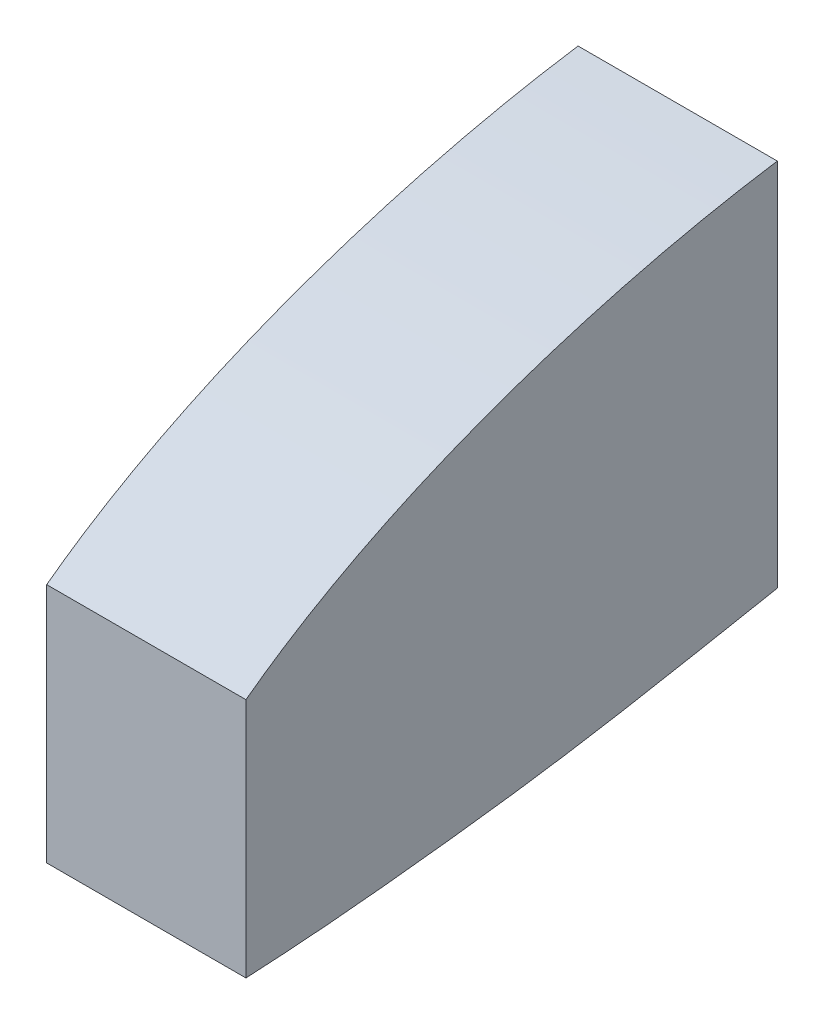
from build123d import *

# Parameters (mm, degrees)
BOSS_EXTRUDE1_DEPTH = 9.525


with BuildPart() as part:
    # Sketch1 → Boss-Extrude1 (new body)
    with BuildSketch(Plane(origin=(0, 0, 0), x_dir=(0, 0, -1), z_dir=(1, 0, 0))):
        with BuildLine():
            Line((6.35, 9.311423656), (6.35, -2.210463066))
            add(Edge.make_bspline(
                [(6.35, -2.210463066), (6.486566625, -2.203811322), (7.565548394, -2.148204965), (9.729376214, -2.005282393), (12.969817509, -1.706991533), (16.602260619, -1.303132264), (20.608996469, -0.785005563), (24.988098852, -0.060426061), (28.737312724, 0.653519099), (31.039491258, 1.092147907), (31.75, 1.227331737)],
                knots=[0.536375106, 0.536375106, 0.536375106, 0.536375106, 0.537715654, 0.546967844, 0.557637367, 0.569620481, 0.582804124, 0.597246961, 0.613135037, 0.620226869, 0.620226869, 0.620226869, 0.620226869], degree=3))
            Line((31.75, 1.227331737), (31.75, 18.908657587))
            add(Edge.make_bspline(
                [(31.75, 18.908657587), (30.828239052, 18.76805762), (28.650628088, 18.39398959), (25.29796595, 17.648544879), (21.762159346, 16.672941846), (18.446208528, 15.570753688), (15.364223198, 14.367776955), (12.535354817, 13.070455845), (9.968683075, 11.705146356), (7.933265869, 10.445275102), (6.770841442, 9.624369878), (6.35, 9.311423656)],
                knots=[1.383511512, 1.383511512, 1.383511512, 1.383511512, 1.392652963, 1.405170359, 1.417171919, 1.428603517, 1.439418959, 1.449596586, 1.459102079, 1.467907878, 1.473049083, 1.473049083, 1.473049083, 1.473049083], degree=3))
        make_face()
    extrude(amount=BOSS_EXTRUDE1_DEPTH)


solid = part.part
